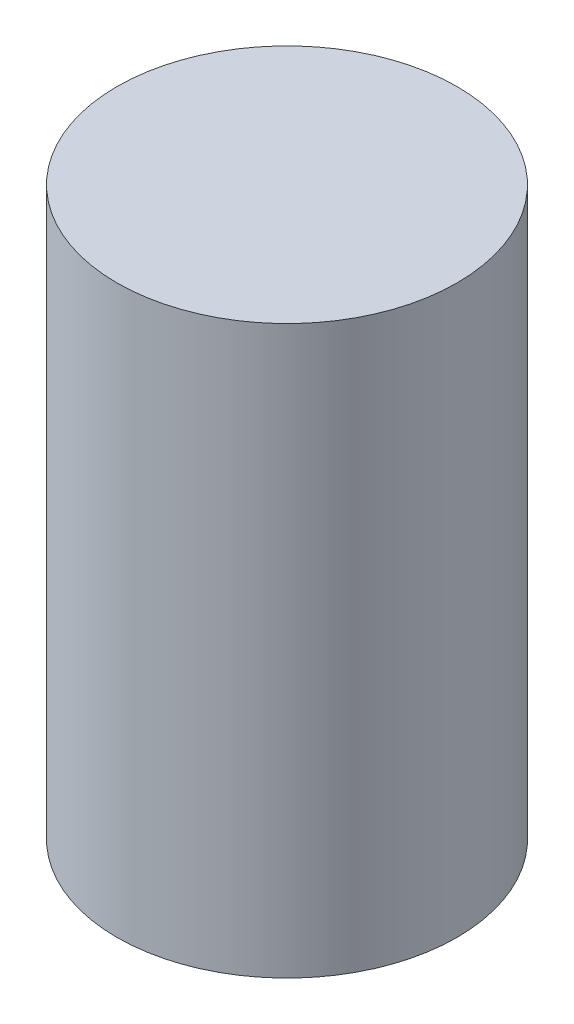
from build123d import *

# Parameters (mm, degrees)
SKETCH_1_R      = 15
EXTRUDE_1_DEPTH = 50


with BuildPart() as part:
    # Sketch 1 → Extrude 1 (new body)
    with BuildSketch(Plane(origin=(0, 0, 0), x_dir=(1, 0, 0), z_dir=(0, 1, 0))):
        with Locations(Location((0, 0, 0), (0, 0, 270))):
            Circle(SKETCH_1_R)
    extrude(amount=EXTRUDE_1_DEPTH)


solid = part.part
